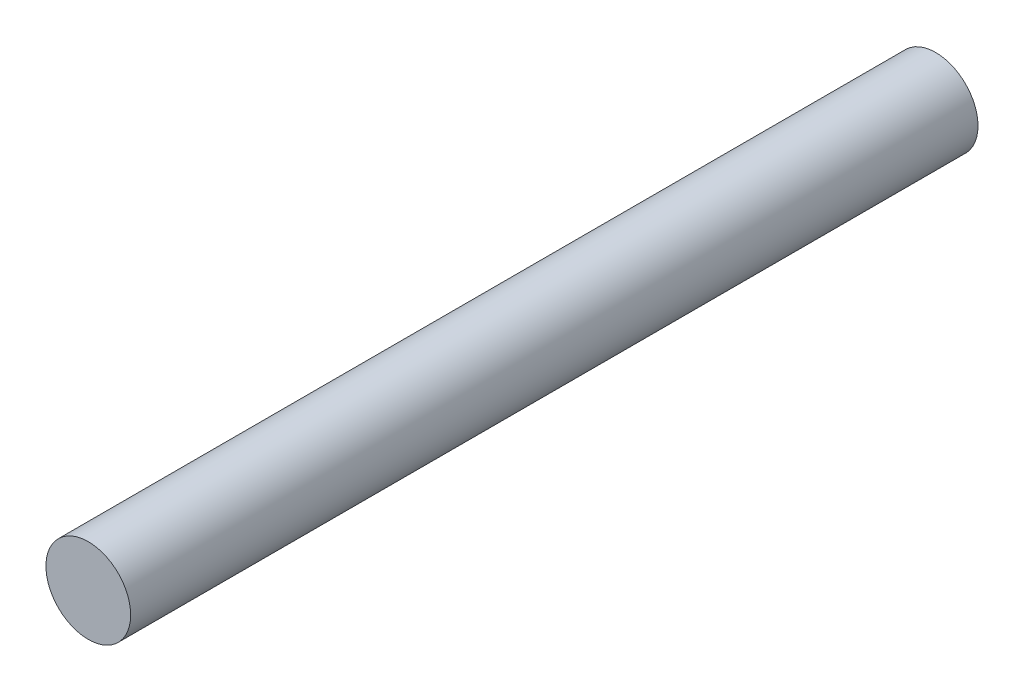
from build123d import *

# Parameters (mm, degrees)
ESQUISSE1_R        = 1.5
BOSS_EXTRU_1_DEPTH = 30


with BuildPart() as part:
    # Esquisse1 → Boss.-Extru.1 (new body)
    with BuildSketch(Plane.XY):
        Circle(ESQUISSE1_R)
    extrude(amount=BOSS_EXTRU_1_DEPTH)


solid = part.part
